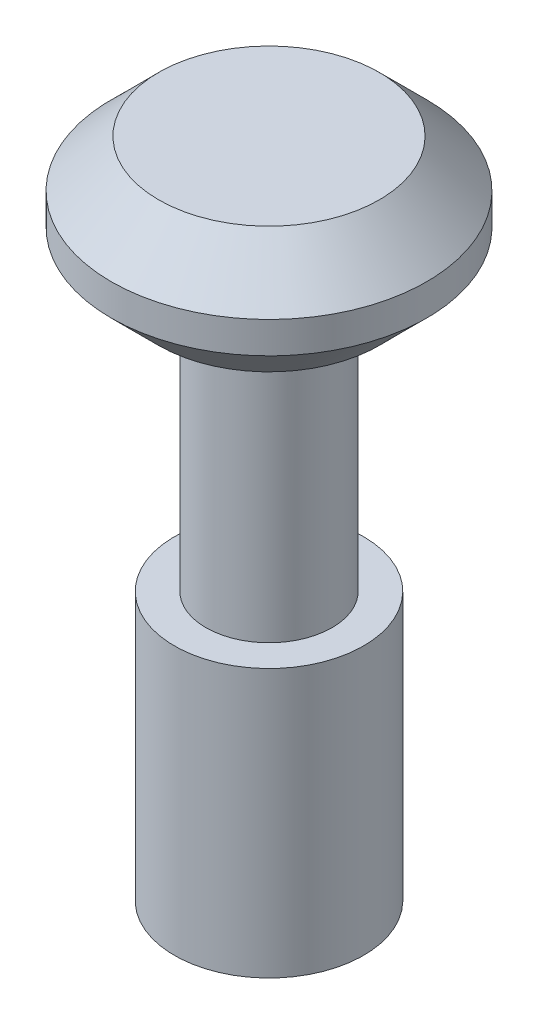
from build123d import *

# Parameters (mm, degrees)
SKIZZE1_R                       = 5
AUFSATZ_LINEAR_AUSTRAGEN1_DEPTH = 4
FASE1_SIZE                      = 1.5
SKIZZE2_R                       = 2
AUFSATZ_LINEAR_AUSTRAGEN2_DEPTH = 8.5
SKIZZE3_R                       = 3
AUFSATZ_LINEAR_AUSTRAGEN3_DEPTH = 8.5
M3_GEWINDEBOHRUNG1_D            = 2.5
M3_GEWINDEBOHRUNG1_DEPTH        = 5
M3_GEWINDEBOHRUNG1_TIP          = 0.751075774


with BuildPart() as part:
    # Skizze1 → Aufsatz-Linear austragen1 (new body)
    with BuildSketch(Plane(origin=(0, 0, 0), x_dir=(1, 0, 0), z_dir=(0, 1, 0))):
        with Locations(Location((0, 0, 0), (0, 0, 270))):
            Circle(SKIZZE1_R)
    extrude(amount=AUFSATZ_LINEAR_AUSTRAGEN1_DEPTH)

    # Fase1
    fase1_edges = [part.edges().sort_by_distance(p)[0] for p in [
        (0, 0, -5),
        (0, 4, -5),
    ]]
    chamfer(fase1_edges, length=FASE1_SIZE)

    # Skizze2 → Aufsatz-Linear austragen2 (add)
    with BuildSketch(Plane.XZ):
        with Locations(Location((0, 0, 0), (0, 0, 90))):
            Circle(SKIZZE2_R)
    extrude(amount=AUFSATZ_LINEAR_AUSTRAGEN2_DEPTH)

    # Skizze3 → Aufsatz-Linear austragen3 (add)
    with BuildSketch(Plane.XZ.offset(8.5)):
        with Locations(Location((0, 0, 0), (0, 0, 270))):
            Circle(SKIZZE3_R)
    extrude(amount=AUFSATZ_LINEAR_AUSTRAGEN3_DEPTH)

    # M3 Gewindebohrung1
    with Locations(Plane(origin=(0, -17, 0), x_dir=(-1, 0, 0), z_dir=(0, -1, 0))):
        with Locations((0, 0)):
            Hole(M3_GEWINDEBOHRUNG1_D / 2, depth=M3_GEWINDEBOHRUNG1_DEPTH)
            with Locations((0, 0, -(M3_GEWINDEBOHRUNG1_DEPTH + M3_GEWINDEBOHRUNG1_TIP / 2))):  # 118° drill point
                Cone(0, M3_GEWINDEBOHRUNG1_D / 2, M3_GEWINDEBOHRUNG1_TIP, mode=Mode.SUBTRACT)


solid = part.part
